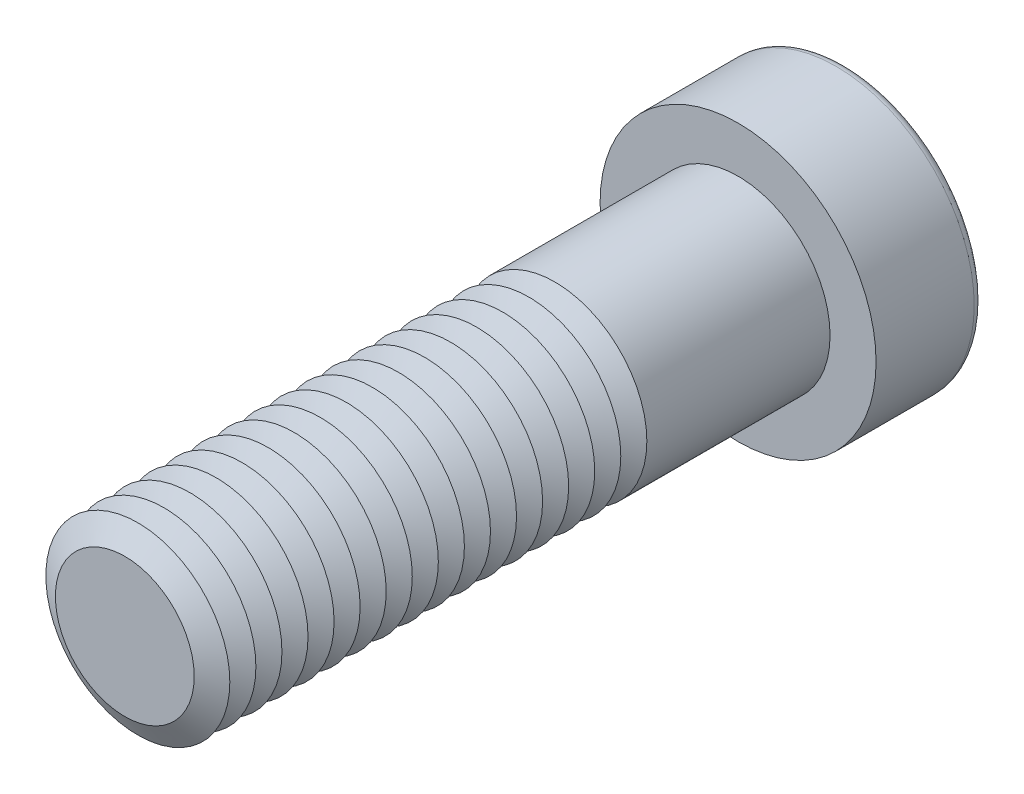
ISO-10303-21;
HEADER;
FILE_DESCRIPTION(('STEP AP214'),'2;1');
FILE_NAME('part.step','',(''),(''),'','','');
FILE_SCHEMA(('AUTOMOTIVE_DESIGN { 1 0 10303 214 1 1 1 1 }'));
ENDSEC;
DATA;
#1=APPLICATION_CONTEXT('core data for automotive mechanical design processes');
#2=APPLICATION_PROTOCOL_DEFINITION('international standard','automotive_design',2000,#1);
#3=PRODUCT_CONTEXT('',#1,'mechanical');
#4=PRODUCT('Part','Part','',(#3));
#5=PRODUCT_RELATED_PRODUCT_CATEGORY('part','',(#4));
#6=PRODUCT_DEFINITION_FORMATION('','',#4);
#7=PRODUCT_DEFINITION_CONTEXT('part definition',#1,'design');
#8=PRODUCT_DEFINITION('design','',#6,#7);
#9=PRODUCT_DEFINITION_SHAPE('','',#8);
#10=(LENGTH_UNIT() NAMED_UNIT(*) SI_UNIT(.MILLI.,.METRE.));
#11=(NAMED_UNIT(*) PLANE_ANGLE_UNIT() SI_UNIT($,.RADIAN.));
#12=(NAMED_UNIT(*) SI_UNIT($,.STERADIAN.) SOLID_ANGLE_UNIT());
#13=UNCERTAINTY_MEASURE_WITH_UNIT(LENGTH_MEASURE(1.E-05),#10,'distance_accuracy_value','');
#14=(GEOMETRIC_REPRESENTATION_CONTEXT(3) GLOBAL_UNCERTAINTY_ASSIGNED_CONTEXT((#13)) GLOBAL_UNIT_ASSIGNED_CONTEXT((#10,
#11,#12)) REPRESENTATION_CONTEXT('',''));
#15=CARTESIAN_POINT('',(0.,0.,0.));
#16=DIRECTION('',(0.,0.,1.));
#17=DIRECTION('',(1.,0.,0.));
#18=AXIS2_PLACEMENT_3D('',#15,#16,#17);
#19=CARTESIAN_POINT('',(0.,0.,34.05));
#20=DIRECTION('',(0.,0.,1.));
#21=DIRECTION('',(1.,0.,0.));
#22=AXIS2_PLACEMENT_3D('',#19,#20,#21);
#23=CONICAL_SURFACE('',#22,6.,1.0471975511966);
#24=CARTESIAN_POINT('',(0.,0.,33.2));
#25=DIRECTION('',(0.,0.,1.));
#26=DIRECTION('',(1.,0.,0.));
#27=AXIS2_PLACEMENT_3D('',#24,#25,#26);
#28=CIRCLE('',#27,4.52775681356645);
#29=CARTESIAN_POINT('',(4.52775681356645,0.,33.2));
#30=VERTEX_POINT('',#29);
#31=EDGE_CURVE('E314',#30,#30,#28,.T.);
#32=ORIENTED_EDGE('',*,*,#31,.T.);
#33=EDGE_LOOP('',(#32));
#34=FACE_BOUND('',#33,.T.);
#35=CARTESIAN_POINT('',(0.,0.,34.05));
#36=DIRECTION('',(0.,0.,1.));
#37=DIRECTION('',(1.,0.,0.));
#38=AXIS2_PLACEMENT_3D('',#35,#36,#37);
#39=CIRCLE('',#38,6.);
#40=CARTESIAN_POINT('',(6.,0.,34.05));
#41=VERTEX_POINT('',#40);
#42=EDGE_CURVE('E317',#41,#41,#39,.T.);
#43=ORIENTED_EDGE('',*,*,#42,.F.);
#44=EDGE_LOOP('',(#43));
#45=FACE_BOUND('',#44,.T.);
#46=ADVANCED_FACE('F39',(#34,#45),#23,.T.);
#47=CARTESIAN_POINT('',(0.,0.,33.2));
#48=DIRECTION('',(0.,0.,-1.));
#49=DIRECTION('',(-1.,0.,0.));
#50=AXIS2_PLACEMENT_3D('',#47,#48,#49);
#51=CONICAL_SURFACE('',#50,4.52775681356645,1.0471975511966);
#52=CARTESIAN_POINT('',(0.,0.,32.35));
#53=DIRECTION('',(0.,0.,1.));
#54=DIRECTION('',(1.,0.,0.));
#55=AXIS2_PLACEMENT_3D('',#52,#53,#54);
#56=CIRCLE('',#55,6.);
#57=CARTESIAN_POINT('',(6.,0.,32.35));
#58=VERTEX_POINT('',#57);
#59=EDGE_CURVE('E325',#58,#58,#56,.T.);
#60=ORIENTED_EDGE('',*,*,#59,.T.);
#61=EDGE_LOOP('',(#60));
#62=FACE_BOUND('',#61,.T.);
#63=ORIENTED_EDGE('',*,*,#31,.F.);
#64=EDGE_LOOP('',(#63));
#65=FACE_BOUND('',#64,.T.);
#66=ADVANCED_FACE('F245',(#62,#65),#51,.T.);
#67=CARTESIAN_POINT('',(0.,0.,40.));
#68=DIRECTION('',(0.,0.,1.));
#69=DIRECTION('',(1.,0.,0.));
#70=AXIS2_PLACEMENT_3D('',#67,#68,#69);
#71=PLANE('',#70);
#72=CARTESIAN_POINT('',(0.,0.,40.));
#73=DIRECTION('',(0.,0.,1.));
#74=DIRECTION('',(1.,0.,0.));
#75=AXIS2_PLACEMENT_3D('',#72,#73,#74);
#76=CIRCLE('',#75,4.52775681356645);
#77=CARTESIAN_POINT('',(4.52775681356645,0.,40.));
#78=VERTEX_POINT('',#77);
#79=EDGE_CURVE('E174',#78,#78,#76,.T.);
#80=ORIENTED_EDGE('',*,*,#79,.T.);
#81=EDGE_LOOP('',(#80));
#82=FACE_BOUND('',#81,.T.);
#83=ADVANCED_FACE('F251',(#82),#71,.T.);
#84=CARTESIAN_POINT('',(0.,0.,40.));
#85=DIRECTION('',(0.,0.,-1.));
#86=DIRECTION('',(-1.,0.,0.));
#87=AXIS2_PLACEMENT_3D('',#84,#85,#86);
#88=CONICAL_SURFACE('',#87,4.52775681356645,1.0471975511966);
#89=CARTESIAN_POINT('',(0.,0.,39.15));
#90=DIRECTION('',(0.,0.,1.));
#91=DIRECTION('',(1.,0.,0.));
#92=AXIS2_PLACEMENT_3D('',#89,#90,#91);
#93=CIRCLE('',#92,6.);
#94=CARTESIAN_POINT('',(6.,0.,39.15));
#95=VERTEX_POINT('',#94);
#96=EDGE_CURVE('E291',#95,#95,#93,.T.);
#97=ORIENTED_EDGE('',*,*,#96,.T.);
#98=EDGE_LOOP('',(#97));
#99=FACE_BOUND('',#98,.T.);
#100=ORIENTED_EDGE('',*,*,#79,.F.);
#101=EDGE_LOOP('',(#100));
#102=FACE_BOUND('',#101,.T.);
#103=ADVANCED_FACE('F199',(#99,#102),#88,.T.);
#104=CARTESIAN_POINT('',(0.,0.,39.15));
#105=DIRECTION('',(0.,0.,1.));
#106=DIRECTION('',(1.,0.,0.));
#107=AXIS2_PLACEMENT_3D('',#104,#105,#106);
#108=CONICAL_SURFACE('',#107,6.,1.0471975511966);
#109=CARTESIAN_POINT('',(0.,0.,38.3));
#110=DIRECTION('',(0.,0.,1.));
#111=DIRECTION('',(1.,0.,0.));
#112=AXIS2_PLACEMENT_3D('',#109,#110,#111);
#113=CIRCLE('',#112,4.52775681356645);
#114=CARTESIAN_POINT('',(4.52775681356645,0.,38.3));
#115=VERTEX_POINT('',#114);
#116=EDGE_CURVE('E288',#115,#115,#113,.T.);
#117=ORIENTED_EDGE('',*,*,#116,.T.);
#118=EDGE_LOOP('',(#117));
#119=FACE_BOUND('',#118,.T.);
#120=ORIENTED_EDGE('',*,*,#96,.F.);
#121=EDGE_LOOP('',(#120));
#122=FACE_BOUND('',#121,.T.);
#123=ADVANCED_FACE('F277',(#119,#122),#108,.T.);
#124=CARTESIAN_POINT('',(0.,0.,38.3));
#125=DIRECTION('',(0.,0.,-1.));
#126=DIRECTION('',(-1.,0.,0.));
#127=AXIS2_PLACEMENT_3D('',#124,#125,#126);
#128=CONICAL_SURFACE('',#127,4.52775681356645,1.0471975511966);
#129=CARTESIAN_POINT('',(0.,0.,37.45));
#130=DIRECTION('',(0.,0.,1.));
#131=DIRECTION('',(1.,0.,0.));
#132=AXIS2_PLACEMENT_3D('',#129,#130,#131);
#133=CIRCLE('',#132,6.);
#134=CARTESIAN_POINT('',(6.,0.,37.45));
#135=VERTEX_POINT('',#134);
#136=EDGE_CURVE('E300',#135,#135,#133,.T.);
#137=ORIENTED_EDGE('',*,*,#136,.T.);
#138=EDGE_LOOP('',(#137));
#139=FACE_BOUND('',#138,.T.);
#140=ORIENTED_EDGE('',*,*,#116,.F.);
#141=EDGE_LOOP('',(#140));
#142=FACE_BOUND('',#141,.T.);
#143=ADVANCED_FACE('F274',(#139,#142),#128,.T.);
#144=CARTESIAN_POINT('',(0.,0.,37.45));
#145=DIRECTION('',(0.,0.,1.));
#146=DIRECTION('',(1.,0.,0.));
#147=AXIS2_PLACEMENT_3D('',#144,#145,#146);
#148=CONICAL_SURFACE('',#147,6.,1.0471975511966);
#149=CARTESIAN_POINT('',(0.,0.,36.6));
#150=DIRECTION('',(0.,0.,1.));
#151=DIRECTION('',(1.,0.,0.));
#152=AXIS2_PLACEMENT_3D('',#149,#150,#151);
#153=CIRCLE('',#152,4.52775681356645);
#154=CARTESIAN_POINT('',(4.52775681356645,0.,36.6));
#155=VERTEX_POINT('',#154);
#156=EDGE_CURVE('E293',#155,#155,#153,.T.);
#157=ORIENTED_EDGE('',*,*,#156,.T.);
#158=EDGE_LOOP('',(#157));
#159=FACE_BOUND('',#158,.T.);
#160=ORIENTED_EDGE('',*,*,#136,.F.);
#161=EDGE_LOOP('',(#160));
#162=FACE_BOUND('',#161,.T.);
#163=ADVANCED_FACE('F270',(#159,#162),#148,.T.);
#164=CARTESIAN_POINT('',(0.,0.,36.6));
#165=DIRECTION('',(0.,0.,-1.));
#166=DIRECTION('',(-1.,0.,0.));
#167=AXIS2_PLACEMENT_3D('',#164,#165,#166);
#168=CONICAL_SURFACE('',#167,4.52775681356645,1.0471975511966);
#169=CARTESIAN_POINT('',(0.,0.,35.75));
#170=DIRECTION('',(0.,0.,1.));
#171=DIRECTION('',(1.,0.,0.));
#172=AXIS2_PLACEMENT_3D('',#169,#170,#171);
#173=CIRCLE('',#172,6.);
#174=CARTESIAN_POINT('',(6.,0.,35.75));
#175=VERTEX_POINT('',#174);
#176=EDGE_CURVE('E310',#175,#175,#173,.T.);
#177=ORIENTED_EDGE('',*,*,#176,.T.);
#178=EDGE_LOOP('',(#177));
#179=FACE_BOUND('',#178,.T.);
#180=ORIENTED_EDGE('',*,*,#156,.F.);
#181=EDGE_LOOP('',(#180));
#182=FACE_BOUND('',#181,.T.);
#183=ADVANCED_FACE('F266',(#179,#182),#168,.T.);
#184=CARTESIAN_POINT('',(0.,0.,35.75));
#185=DIRECTION('',(0.,0.,1.));
#186=DIRECTION('',(1.,0.,0.));
#187=AXIS2_PLACEMENT_3D('',#184,#185,#186);
#188=CONICAL_SURFACE('',#187,6.,1.0471975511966);
#189=CARTESIAN_POINT('',(0.,0.,34.9));
#190=DIRECTION('',(0.,0.,1.));
#191=DIRECTION('',(1.,0.,0.));
#192=AXIS2_PLACEMENT_3D('',#189,#190,#191);
#193=CIRCLE('',#192,4.52775681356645);
#194=CARTESIAN_POINT('',(4.52775681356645,0.,34.9));
#195=VERTEX_POINT('',#194);
#196=EDGE_CURVE('E306',#195,#195,#193,.T.);
#197=ORIENTED_EDGE('',*,*,#196,.T.);
#198=EDGE_LOOP('',(#197));
#199=FACE_BOUND('',#198,.T.);
#200=ORIENTED_EDGE('',*,*,#176,.F.);
#201=EDGE_LOOP('',(#200));
#202=FACE_BOUND('',#201,.T.);
#203=ADVANCED_FACE('F262',(#199,#202),#188,.T.);
#204=CARTESIAN_POINT('',(0.,0.,34.9));
#205=DIRECTION('',(0.,0.,-1.));
#206=DIRECTION('',(-1.,0.,0.));
#207=AXIS2_PLACEMENT_3D('',#204,#205,#206);
#208=CONICAL_SURFACE('',#207,4.52775681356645,1.0471975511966);
#209=ORIENTED_EDGE('',*,*,#42,.T.);
#210=EDGE_LOOP('',(#209));
#211=FACE_BOUND('',#210,.T.);
#212=ORIENTED_EDGE('',*,*,#196,.F.);
#213=EDGE_LOOP('',(#212));
#214=FACE_BOUND('',#213,.T.);
#215=ADVANCED_FACE('F258',(#211,#214),#208,.T.);
#216=CARTESIAN_POINT('',(0.,0.,32.35));
#217=DIRECTION('',(0.,0.,1.));
#218=DIRECTION('',(1.,0.,0.));
#219=AXIS2_PLACEMENT_3D('',#216,#217,#218);
#220=CONICAL_SURFACE('',#219,6.,1.0471975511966);
#221=CARTESIAN_POINT('',(0.,0.,31.5));
#222=DIRECTION('',(0.,0.,1.));
#223=DIRECTION('',(1.,0.,0.));
#224=AXIS2_PLACEMENT_3D('',#221,#222,#223);
#225=CIRCLE('',#224,4.52775681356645);
#226=CARTESIAN_POINT('',(4.52775681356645,0.,31.5));
#227=VERTEX_POINT('',#226);
#228=EDGE_CURVE('E321',#227,#227,#225,.T.);
#229=ORIENTED_EDGE('',*,*,#228,.T.);
#230=EDGE_LOOP('',(#229));
#231=FACE_BOUND('',#230,.T.);
#232=ORIENTED_EDGE('',*,*,#59,.F.);
#233=EDGE_LOOP('',(#232));
#234=FACE_BOUND('',#233,.T.);
#235=ADVANCED_FACE('F261',(#231,#234),#220,.T.);
#236=CARTESIAN_POINT('',(0.,0.,31.5));
#237=DIRECTION('',(0.,0.,-1.));
#238=DIRECTION('',(-1.,0.,0.));
#239=AXIS2_PLACEMENT_3D('',#236,#237,#238);
#240=CONICAL_SURFACE('',#239,4.52775681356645,1.0471975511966);
#241=CARTESIAN_POINT('',(0.,0.,30.65));
#242=DIRECTION('',(0.,0.,1.));
#243=DIRECTION('',(1.,0.,0.));
#244=AXIS2_PLACEMENT_3D('',#241,#242,#243);
#245=CIRCLE('',#244,6.);
#246=CARTESIAN_POINT('',(6.,0.,30.65));
#247=VERTEX_POINT('',#246);
#248=EDGE_CURVE('E333',#247,#247,#245,.T.);
#249=ORIENTED_EDGE('',*,*,#248,.T.);
#250=EDGE_LOOP('',(#249));
#251=FACE_BOUND('',#250,.T.);
#252=ORIENTED_EDGE('',*,*,#228,.F.);
#253=EDGE_LOOP('',(#252));
#254=FACE_BOUND('',#253,.T.);
#255=ADVANCED_FACE('F513',(#251,#254),#240,.T.);
#256=CARTESIAN_POINT('',(0.,0.,30.65));
#257=DIRECTION('',(0.,0.,1.));
#258=DIRECTION('',(1.,0.,0.));
#259=AXIS2_PLACEMENT_3D('',#256,#257,#258);
#260=CONICAL_SURFACE('',#259,6.,1.0471975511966);
#261=CARTESIAN_POINT('',(0.,0.,29.8));
#262=DIRECTION('',(0.,0.,1.));
#263=DIRECTION('',(1.,0.,0.));
#264=AXIS2_PLACEMENT_3D('',#261,#262,#263);
#265=CIRCLE('',#264,4.52775681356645);
#266=CARTESIAN_POINT('',(4.52775681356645,0.,29.8));
#267=VERTEX_POINT('',#266);
#268=EDGE_CURVE('E329',#267,#267,#265,.T.);
#269=ORIENTED_EDGE('',*,*,#268,.T.);
#270=EDGE_LOOP('',(#269));
#271=FACE_BOUND('',#270,.T.);
#272=ORIENTED_EDGE('',*,*,#248,.F.);
#273=EDGE_LOOP('',(#272));
#274=FACE_BOUND('',#273,.T.);
#275=ADVANCED_FACE('F509',(#271,#274),#260,.T.);
#276=CARTESIAN_POINT('',(0.,0.,29.8));
#277=DIRECTION('',(0.,0.,-1.));
#278=DIRECTION('',(-1.,0.,0.));
#279=AXIS2_PLACEMENT_3D('',#276,#277,#278);
#280=CONICAL_SURFACE('',#279,4.52775681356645,1.0471975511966);
#281=CARTESIAN_POINT('',(0.,0.,28.95));
#282=DIRECTION('',(0.,0.,1.));
#283=DIRECTION('',(1.,0.,0.));
#284=AXIS2_PLACEMENT_3D('',#281,#282,#283);
#285=CIRCLE('',#284,6.);
#286=CARTESIAN_POINT('',(6.,0.,28.95));
#287=VERTEX_POINT('',#286);
#288=EDGE_CURVE('E341',#287,#287,#285,.T.);
#289=ORIENTED_EDGE('',*,*,#288,.T.);
#290=EDGE_LOOP('',(#289));
#291=FACE_BOUND('',#290,.T.);
#292=ORIENTED_EDGE('',*,*,#268,.F.);
#293=EDGE_LOOP('',(#292));
#294=FACE_BOUND('',#293,.T.);
#295=ADVANCED_FACE('F505',(#291,#294),#280,.T.);
#296=CARTESIAN_POINT('',(0.,0.,28.95));
#297=DIRECTION('',(0.,0.,1.));
#298=DIRECTION('',(1.,0.,0.));
#299=AXIS2_PLACEMENT_3D('',#296,#297,#298);
#300=CONICAL_SURFACE('',#299,6.,1.0471975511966);
#301=CARTESIAN_POINT('',(0.,0.,28.1));
#302=DIRECTION('',(0.,0.,1.));
#303=DIRECTION('',(1.,0.,0.));
#304=AXIS2_PLACEMENT_3D('',#301,#302,#303);
#305=CIRCLE('',#304,4.52775681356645);
#306=CARTESIAN_POINT('',(4.52775681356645,0.,28.1));
#307=VERTEX_POINT('',#306);
#308=EDGE_CURVE('E337',#307,#307,#305,.T.);
#309=ORIENTED_EDGE('',*,*,#308,.T.);
#310=EDGE_LOOP('',(#309));
#311=FACE_BOUND('',#310,.T.);
#312=ORIENTED_EDGE('',*,*,#288,.F.);
#313=EDGE_LOOP('',(#312));
#314=FACE_BOUND('',#313,.T.);
#315=ADVANCED_FACE('F501',(#311,#314),#300,.T.);
#316=CARTESIAN_POINT('',(0.,0.,28.1));
#317=DIRECTION('',(0.,0.,-1.));
#318=DIRECTION('',(-1.,0.,0.));
#319=AXIS2_PLACEMENT_3D('',#316,#317,#318);
#320=CONICAL_SURFACE('',#319,4.52775681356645,1.0471975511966);
#321=CARTESIAN_POINT('',(0.,0.,27.25));
#322=DIRECTION('',(0.,0.,1.));
#323=DIRECTION('',(1.,0.,0.));
#324=AXIS2_PLACEMENT_3D('',#321,#322,#323);
#325=CIRCLE('',#324,6.);
#326=CARTESIAN_POINT('',(6.,0.,27.25));
#327=VERTEX_POINT('',#326);
#328=EDGE_CURVE('E349',#327,#327,#325,.T.);
#329=ORIENTED_EDGE('',*,*,#328,.T.);
#330=EDGE_LOOP('',(#329));
#331=FACE_BOUND('',#330,.T.);
#332=ORIENTED_EDGE('',*,*,#308,.F.);
#333=EDGE_LOOP('',(#332));
#334=FACE_BOUND('',#333,.T.);
#335=ADVANCED_FACE('F497',(#331,#334),#320,.T.);
#336=CARTESIAN_POINT('',(0.,0.,27.25));
#337=DIRECTION('',(0.,0.,1.));
#338=DIRECTION('',(1.,0.,0.));
#339=AXIS2_PLACEMENT_3D('',#336,#337,#338);
#340=CONICAL_SURFACE('',#339,6.,1.0471975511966);
#341=CARTESIAN_POINT('',(0.,0.,26.4));
#342=DIRECTION('',(0.,0.,1.));
#343=DIRECTION('',(1.,0.,0.));
#344=AXIS2_PLACEMENT_3D('',#341,#342,#343);
#345=CIRCLE('',#344,4.52775681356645);
#346=CARTESIAN_POINT('',(4.52775681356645,0.,26.4));
#347=VERTEX_POINT('',#346);
#348=EDGE_CURVE('E345',#347,#347,#345,.T.);
#349=ORIENTED_EDGE('',*,*,#348,.T.);
#350=EDGE_LOOP('',(#349));
#351=FACE_BOUND('',#350,.T.);
#352=ORIENTED_EDGE('',*,*,#328,.F.);
#353=EDGE_LOOP('',(#352));
#354=FACE_BOUND('',#353,.T.);
#355=ADVANCED_FACE('F493',(#351,#354),#340,.T.);
#356=CARTESIAN_POINT('',(0.,0.,26.4));
#357=DIRECTION('',(0.,0.,-1.));
#358=DIRECTION('',(-1.,0.,0.));
#359=AXIS2_PLACEMENT_3D('',#356,#357,#358);
#360=CONICAL_SURFACE('',#359,4.52775681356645,1.0471975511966);
#361=CARTESIAN_POINT('',(0.,0.,25.55));
#362=DIRECTION('',(0.,0.,1.));
#363=DIRECTION('',(1.,0.,0.));
#364=AXIS2_PLACEMENT_3D('',#361,#362,#363);
#365=CIRCLE('',#364,6.);
#366=CARTESIAN_POINT('',(6.,0.,25.55));
#367=VERTEX_POINT('',#366);
#368=EDGE_CURVE('E357',#367,#367,#365,.T.);
#369=ORIENTED_EDGE('',*,*,#368,.T.);
#370=EDGE_LOOP('',(#369));
#371=FACE_BOUND('',#370,.T.);
#372=ORIENTED_EDGE('',*,*,#348,.F.);
#373=EDGE_LOOP('',(#372));
#374=FACE_BOUND('',#373,.T.);
#375=ADVANCED_FACE('F489',(#371,#374),#360,.T.);
#376=CARTESIAN_POINT('',(0.,0.,25.55));
#377=DIRECTION('',(0.,0.,1.));
#378=DIRECTION('',(1.,0.,0.));
#379=AXIS2_PLACEMENT_3D('',#376,#377,#378);
#380=CONICAL_SURFACE('',#379,6.,1.0471975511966);
#381=CARTESIAN_POINT('',(0.,0.,24.7));
#382=DIRECTION('',(0.,0.,1.));
#383=DIRECTION('',(1.,0.,0.));
#384=AXIS2_PLACEMENT_3D('',#381,#382,#383);
#385=CIRCLE('',#384,4.52775681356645);
#386=CARTESIAN_POINT('',(4.52775681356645,0.,24.7));
#387=VERTEX_POINT('',#386);
#388=EDGE_CURVE('E353',#387,#387,#385,.T.);
#389=ORIENTED_EDGE('',*,*,#388,.T.);
#390=EDGE_LOOP('',(#389));
#391=FACE_BOUND('',#390,.T.);
#392=ORIENTED_EDGE('',*,*,#368,.F.);
#393=EDGE_LOOP('',(#392));
#394=FACE_BOUND('',#393,.T.);
#395=ADVANCED_FACE('F485',(#391,#394),#380,.T.);
#396=CARTESIAN_POINT('',(0.,0.,24.7));
#397=DIRECTION('',(0.,0.,-1.));
#398=DIRECTION('',(-1.,0.,0.));
#399=AXIS2_PLACEMENT_3D('',#396,#397,#398);
#400=CONICAL_SURFACE('',#399,4.52775681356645,1.0471975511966);
#401=CARTESIAN_POINT('',(0.,0.,23.85));
#402=DIRECTION('',(0.,0.,1.));
#403=DIRECTION('',(1.,0.,0.));
#404=AXIS2_PLACEMENT_3D('',#401,#402,#403);
#405=CIRCLE('',#404,6.);
#406=CARTESIAN_POINT('',(6.,0.,23.85));
#407=VERTEX_POINT('',#406);
#408=EDGE_CURVE('E365',#407,#407,#405,.T.);
#409=ORIENTED_EDGE('',*,*,#408,.T.);
#410=EDGE_LOOP('',(#409));
#411=FACE_BOUND('',#410,.T.);
#412=ORIENTED_EDGE('',*,*,#388,.F.);
#413=EDGE_LOOP('',(#412));
#414=FACE_BOUND('',#413,.T.);
#415=ADVANCED_FACE('F481',(#411,#414),#400,.T.);
#416=CARTESIAN_POINT('',(0.,0.,23.85));
#417=DIRECTION('',(0.,0.,1.));
#418=DIRECTION('',(1.,0.,0.));
#419=AXIS2_PLACEMENT_3D('',#416,#417,#418);
#420=CONICAL_SURFACE('',#419,6.,1.0471975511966);
#421=CARTESIAN_POINT('',(0.,0.,23.));
#422=DIRECTION('',(0.,0.,1.));
#423=DIRECTION('',(1.,0.,0.));
#424=AXIS2_PLACEMENT_3D('',#421,#422,#423);
#425=CIRCLE('',#424,4.52775681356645);
#426=CARTESIAN_POINT('',(4.52775681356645,0.,23.));
#427=VERTEX_POINT('',#426);
#428=EDGE_CURVE('E361',#427,#427,#425,.T.);
#429=ORIENTED_EDGE('',*,*,#428,.T.);
#430=EDGE_LOOP('',(#429));
#431=FACE_BOUND('',#430,.T.);
#432=ORIENTED_EDGE('',*,*,#408,.F.);
#433=EDGE_LOOP('',(#432));
#434=FACE_BOUND('',#433,.T.);
#435=ADVANCED_FACE('F477',(#431,#434),#420,.T.);
#436=CARTESIAN_POINT('',(0.,0.,23.));
#437=DIRECTION('',(0.,0.,-1.));
#438=DIRECTION('',(-1.,0.,0.));
#439=AXIS2_PLACEMENT_3D('',#436,#437,#438);
#440=CONICAL_SURFACE('',#439,4.52775681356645,1.0471975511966);
#441=CARTESIAN_POINT('',(0.,0.,22.15));
#442=DIRECTION('',(0.,0.,1.));
#443=DIRECTION('',(1.,0.,0.));
#444=AXIS2_PLACEMENT_3D('',#441,#442,#443);
#445=CIRCLE('',#444,6.);
#446=CARTESIAN_POINT('',(6.,0.,22.15));
#447=VERTEX_POINT('',#446);
#448=EDGE_CURVE('E372',#447,#447,#445,.T.);
#449=ORIENTED_EDGE('',*,*,#448,.T.);
#450=EDGE_LOOP('',(#449));
#451=FACE_BOUND('',#450,.T.);
#452=ORIENTED_EDGE('',*,*,#428,.F.);
#453=EDGE_LOOP('',(#452));
#454=FACE_BOUND('',#453,.T.);
#455=ADVANCED_FACE('F473',(#451,#454),#440,.T.);
#456=CARTESIAN_POINT('',(0.,0.,22.15));
#457=DIRECTION('',(0.,0.,1.));
#458=DIRECTION('',(1.,0.,0.));
#459=AXIS2_PLACEMENT_3D('',#456,#457,#458);
#460=CONICAL_SURFACE('',#459,6.,1.0471975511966);
#461=CARTESIAN_POINT('',(0.,0.,21.3));
#462=DIRECTION('',(0.,0.,1.));
#463=DIRECTION('',(1.,0.,0.));
#464=AXIS2_PLACEMENT_3D('',#461,#462,#463);
#465=CIRCLE('',#464,4.52775681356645);
#466=CARTESIAN_POINT('',(4.52775681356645,0.,21.3));
#467=VERTEX_POINT('',#466);
#468=EDGE_CURVE('E369',#467,#467,#465,.T.);
#469=ORIENTED_EDGE('',*,*,#468,.T.);
#470=EDGE_LOOP('',(#469));
#471=FACE_BOUND('',#470,.T.);
#472=ORIENTED_EDGE('',*,*,#448,.F.);
#473=EDGE_LOOP('',(#472));
#474=FACE_BOUND('',#473,.T.);
#475=ADVANCED_FACE('F469',(#471,#474),#460,.T.);
#476=CARTESIAN_POINT('',(0.,0.,21.3));
#477=DIRECTION('',(0.,0.,-1.));
#478=DIRECTION('',(-1.,0.,0.));
#479=AXIS2_PLACEMENT_3D('',#476,#477,#478);
#480=CONICAL_SURFACE('',#479,4.52775681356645,1.0471975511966);
#481=CARTESIAN_POINT('',(0.,0.,20.45));
#482=DIRECTION('',(0.,0.,1.));
#483=DIRECTION('',(1.,0.,0.));
#484=AXIS2_PLACEMENT_3D('',#481,#482,#483);
#485=CIRCLE('',#484,6.);
#486=CARTESIAN_POINT('',(6.,0.,20.45));
#487=VERTEX_POINT('',#486);
#488=EDGE_CURVE('E380',#487,#487,#485,.T.);
#489=ORIENTED_EDGE('',*,*,#488,.T.);
#490=EDGE_LOOP('',(#489));
#491=FACE_BOUND('',#490,.T.);
#492=ORIENTED_EDGE('',*,*,#468,.F.);
#493=EDGE_LOOP('',(#492));
#494=FACE_BOUND('',#493,.T.);
#495=ADVANCED_FACE('F465',(#491,#494),#480,.T.);
#496=CARTESIAN_POINT('',(0.,0.,20.45));
#497=DIRECTION('',(0.,0.,1.));
#498=DIRECTION('',(1.,0.,0.));
#499=AXIS2_PLACEMENT_3D('',#496,#497,#498);
#500=CONICAL_SURFACE('',#499,6.,1.0471975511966);
#501=CARTESIAN_POINT('',(0.,0.,19.6));
#502=DIRECTION('',(0.,0.,1.));
#503=DIRECTION('',(1.,0.,0.));
#504=AXIS2_PLACEMENT_3D('',#501,#502,#503);
#505=CIRCLE('',#504,4.52775681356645);
#506=CARTESIAN_POINT('',(4.52775681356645,0.,19.6));
#507=VERTEX_POINT('',#506);
#508=EDGE_CURVE('E376',#507,#507,#505,.T.);
#509=ORIENTED_EDGE('',*,*,#508,.T.);
#510=EDGE_LOOP('',(#509));
#511=FACE_BOUND('',#510,.T.);
#512=ORIENTED_EDGE('',*,*,#488,.F.);
#513=EDGE_LOOP('',(#512));
#514=FACE_BOUND('',#513,.T.);
#515=ADVANCED_FACE('F461',(#511,#514),#500,.T.);
#516=CARTESIAN_POINT('',(0.,0.,19.6));
#517=DIRECTION('',(0.,0.,-1.));
#518=DIRECTION('',(-1.,0.,0.));
#519=AXIS2_PLACEMENT_3D('',#516,#517,#518);
#520=CONICAL_SURFACE('',#519,4.52775681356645,1.0471975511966);
#521=CARTESIAN_POINT('',(0.,0.,18.75));
#522=DIRECTION('',(0.,0.,1.));
#523=DIRECTION('',(1.,0.,0.));
#524=AXIS2_PLACEMENT_3D('',#521,#522,#523);
#525=CIRCLE('',#524,6.);
#526=CARTESIAN_POINT('',(6.,0.,18.75));
#527=VERTEX_POINT('',#526);
#528=EDGE_CURVE('E388',#527,#527,#525,.T.);
#529=ORIENTED_EDGE('',*,*,#528,.T.);
#530=EDGE_LOOP('',(#529));
#531=FACE_BOUND('',#530,.T.);
#532=ORIENTED_EDGE('',*,*,#508,.F.);
#533=EDGE_LOOP('',(#532));
#534=FACE_BOUND('',#533,.T.);
#535=ADVANCED_FACE('F457',(#531,#534),#520,.T.);
#536=CARTESIAN_POINT('',(0.,0.,18.75));
#537=DIRECTION('',(0.,0.,1.));
#538=DIRECTION('',(1.,0.,0.));
#539=AXIS2_PLACEMENT_3D('',#536,#537,#538);
#540=CONICAL_SURFACE('',#539,6.,1.0471975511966);
#541=CARTESIAN_POINT('',(0.,0.,17.9));
#542=DIRECTION('',(0.,0.,1.));
#543=DIRECTION('',(1.,0.,0.));
#544=AXIS2_PLACEMENT_3D('',#541,#542,#543);
#545=CIRCLE('',#544,4.52775681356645);
#546=CARTESIAN_POINT('',(4.52775681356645,0.,17.9));
#547=VERTEX_POINT('',#546);
#548=EDGE_CURVE('E384',#547,#547,#545,.T.);
#549=ORIENTED_EDGE('',*,*,#548,.T.);
#550=EDGE_LOOP('',(#549));
#551=FACE_BOUND('',#550,.T.);
#552=ORIENTED_EDGE('',*,*,#528,.F.);
#553=EDGE_LOOP('',(#552));
#554=FACE_BOUND('',#553,.T.);
#555=ADVANCED_FACE('F453',(#551,#554),#540,.T.);
#556=CARTESIAN_POINT('',(0.,0.,17.9));
#557=DIRECTION('',(0.,0.,-1.));
#558=DIRECTION('',(-1.,0.,0.));
#559=AXIS2_PLACEMENT_3D('',#556,#557,#558);
#560=CONICAL_SURFACE('',#559,4.52775681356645,1.0471975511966);
#561=CARTESIAN_POINT('',(0.,0.,17.05));
#562=DIRECTION('',(0.,0.,1.));
#563=DIRECTION('',(1.,0.,0.));
#564=AXIS2_PLACEMENT_3D('',#561,#562,#563);
#565=CIRCLE('',#564,6.);
#566=CARTESIAN_POINT('',(6.,0.,17.05));
#567=VERTEX_POINT('',#566);
#568=EDGE_CURVE('E396',#567,#567,#565,.T.);
#569=ORIENTED_EDGE('',*,*,#568,.T.);
#570=EDGE_LOOP('',(#569));
#571=FACE_BOUND('',#570,.T.);
#572=ORIENTED_EDGE('',*,*,#548,.F.);
#573=EDGE_LOOP('',(#572));
#574=FACE_BOUND('',#573,.T.);
#575=ADVANCED_FACE('F449',(#571,#574),#560,.T.);
#576=CARTESIAN_POINT('',(0.,0.,17.05));
#577=DIRECTION('',(0.,0.,1.));
#578=DIRECTION('',(1.,0.,0.));
#579=AXIS2_PLACEMENT_3D('',#576,#577,#578);
#580=CONICAL_SURFACE('',#579,6.,1.0471975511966);
#581=CARTESIAN_POINT('',(0.,0.,16.2));
#582=DIRECTION('',(0.,0.,1.));
#583=DIRECTION('',(1.,0.,0.));
#584=AXIS2_PLACEMENT_3D('',#581,#582,#583);
#585=CIRCLE('',#584,4.52775681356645);
#586=CARTESIAN_POINT('',(4.52775681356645,0.,16.2));
#587=VERTEX_POINT('',#586);
#588=EDGE_CURVE('E392',#587,#587,#585,.T.);
#589=ORIENTED_EDGE('',*,*,#588,.T.);
#590=EDGE_LOOP('',(#589));
#591=FACE_BOUND('',#590,.T.);
#592=ORIENTED_EDGE('',*,*,#568,.F.);
#593=EDGE_LOOP('',(#592));
#594=FACE_BOUND('',#593,.T.);
#595=ADVANCED_FACE('F445',(#591,#594),#580,.T.);
#596=CARTESIAN_POINT('',(0.,0.,16.2));
#597=DIRECTION('',(0.,0.,-1.));
#598=DIRECTION('',(-1.,0.,0.));
#599=AXIS2_PLACEMENT_3D('',#596,#597,#598);
#600=CONICAL_SURFACE('',#599,4.52775681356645,1.0471975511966);
#601=CARTESIAN_POINT('',(0.,0.,15.35));
#602=DIRECTION('',(0.,0.,1.));
#603=DIRECTION('',(1.,0.,0.));
#604=AXIS2_PLACEMENT_3D('',#601,#602,#603);
#605=CIRCLE('',#604,6.);
#606=CARTESIAN_POINT('',(6.,0.,15.35));
#607=VERTEX_POINT('',#606);
#608=EDGE_CURVE('E404',#607,#607,#605,.T.);
#609=ORIENTED_EDGE('',*,*,#608,.T.);
#610=EDGE_LOOP('',(#609));
#611=FACE_BOUND('',#610,.T.);
#612=ORIENTED_EDGE('',*,*,#588,.F.);
#613=EDGE_LOOP('',(#612));
#614=FACE_BOUND('',#613,.T.);
#615=ADVANCED_FACE('F441',(#611,#614),#600,.T.);
#616=CARTESIAN_POINT('',(0.,0.,15.35));
#617=DIRECTION('',(0.,0.,1.));
#618=DIRECTION('',(1.,0.,0.));
#619=AXIS2_PLACEMENT_3D('',#616,#617,#618);
#620=CONICAL_SURFACE('',#619,6.,1.0471975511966);
#621=CARTESIAN_POINT('',(0.,0.,14.5));
#622=DIRECTION('',(0.,0.,1.));
#623=DIRECTION('',(1.,0.,0.));
#624=AXIS2_PLACEMENT_3D('',#621,#622,#623);
#625=CIRCLE('',#624,4.52775681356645);
#626=CARTESIAN_POINT('',(4.52775681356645,0.,14.5));
#627=VERTEX_POINT('',#626);
#628=EDGE_CURVE('E400',#627,#627,#625,.T.);
#629=ORIENTED_EDGE('',*,*,#628,.T.);
#630=EDGE_LOOP('',(#629));
#631=FACE_BOUND('',#630,.T.);
#632=ORIENTED_EDGE('',*,*,#608,.F.);
#633=EDGE_LOOP('',(#632));
#634=FACE_BOUND('',#633,.T.);
#635=ADVANCED_FACE('F436',(#631,#634),#620,.T.);
#636=CARTESIAN_POINT('',(0.,0.,14.5));
#637=DIRECTION('',(0.,0.,-1.));
#638=DIRECTION('',(-1.,0.,0.));
#639=AXIS2_PLACEMENT_3D('',#636,#637,#638);
#640=CONICAL_SURFACE('',#639,4.52775681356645,1.0471975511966);
#641=CARTESIAN_POINT('',(0.,0.,13.65));
#642=DIRECTION('',(0.,0.,1.));
#643=DIRECTION('',(1.,0.,0.));
#644=AXIS2_PLACEMENT_3D('',#641,#642,#643);
#645=CIRCLE('',#644,6.);
#646=CARTESIAN_POINT('',(6.,0.,13.65));
#647=VERTEX_POINT('',#646);
#648=EDGE_CURVE('E416',#647,#647,#645,.T.);
#649=ORIENTED_EDGE('',*,*,#648,.T.);
#650=EDGE_LOOP('',(#649));
#651=FACE_BOUND('',#650,.T.);
#652=ORIENTED_EDGE('',*,*,#628,.F.);
#653=EDGE_LOOP('',(#652));
#654=FACE_BOUND('',#653,.T.);
#655=ADVANCED_FACE('F422',(#651,#654),#640,.T.);
#656=CARTESIAN_POINT('',(0.,0.,13.65));
#657=DIRECTION('',(0.,0.,1.));
#658=DIRECTION('',(1.,0.,0.));
#659=AXIS2_PLACEMENT_3D('',#656,#657,#658);
#660=CONICAL_SURFACE('',#659,6.,1.0471975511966);
#661=CARTESIAN_POINT('',(0.,0.,12.8));
#662=DIRECTION('',(0.,0.,1.));
#663=DIRECTION('',(1.,0.,0.));
#664=AXIS2_PLACEMENT_3D('',#661,#662,#663);
#665=CIRCLE('',#664,4.52775681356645);
#666=CARTESIAN_POINT('',(4.52775681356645,0.,12.8));
#667=VERTEX_POINT('',#666);
#668=EDGE_CURVE('E408',#667,#667,#665,.T.);
#669=ORIENTED_EDGE('',*,*,#668,.T.);
#670=EDGE_LOOP('',(#669));
#671=FACE_BOUND('',#670,.T.);
#672=ORIENTED_EDGE('',*,*,#648,.F.);
#673=EDGE_LOOP('',(#672));
#674=FACE_BOUND('',#673,.T.);
#675=ADVANCED_FACE('F425',(#671,#674),#660,.T.);
#676=CARTESIAN_POINT('',(0.,0.,12.8));
#677=DIRECTION('',(0.,0.,-1.));
#678=DIRECTION('',(-1.,0.,0.));
#679=AXIS2_PLACEMENT_3D('',#676,#677,#678);
#680=CONICAL_SURFACE('',#679,4.52775681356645,1.0471975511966);
#681=CARTESIAN_POINT('',(0.,0.,11.95));
#682=DIRECTION('',(0.,0.,1.));
#683=DIRECTION('',(1.,0.,0.));
#684=AXIS2_PLACEMENT_3D('',#681,#682,#683);
#685=CIRCLE('',#684,6.);
#686=CARTESIAN_POINT('',(6.,0.,11.95));
#687=VERTEX_POINT('',#686);
#688=EDGE_CURVE('E412',#687,#687,#685,.T.);
#689=ORIENTED_EDGE('',*,*,#688,.T.);
#690=EDGE_LOOP('',(#689));
#691=FACE_BOUND('',#690,.T.);
#692=ORIENTED_EDGE('',*,*,#668,.F.);
#693=EDGE_LOOP('',(#692));
#694=FACE_BOUND('',#693,.T.);
#695=ADVANCED_FACE('F427',(#691,#694),#680,.T.);
#696=CARTESIAN_POINT('',(0.,0.,-1.));
#697=DIRECTION('',(0.,0.,-1.));
#698=DIRECTION('',(-1.,0.,0.));
#699=AXIS2_PLACEMENT_3D('',#696,#697,#698);
#700=CONICAL_SURFACE('',#699,4.,1.0471975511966);
#701=CARTESIAN_POINT('',(0.,0.,1.30940107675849));
#702=VERTEX_POINT('',#701);
#703=VERTEX_LOOP('',#702);
#704=FACE_BOUND('',#703,.T.);
#705=CARTESIAN_POINT('',(0.,0.,-1.));
#706=DIRECTION('',(0.,0.,-1.));
#707=DIRECTION('',(-1.,0.,0.));
#708=AXIS2_PLACEMENT_3D('',#705,#706,#707);
#709=CIRCLE('',#708,4.);
#710=CARTESIAN_POINT('',(-3.46410161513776,2.,-1.));
#711=VERTEX_POINT('',#710);
#712=CARTESIAN_POINT('',(0.,4.,-1.));
#713=VERTEX_POINT('',#712);
#714=EDGE_CURVE('E149',#711,#713,#709,.T.);
#715=ORIENTED_EDGE('',*,*,#714,.T.);
#716=CARTESIAN_POINT('',(0.,0.,-1.));
#717=DIRECTION('',(0.,0.,-1.));
#718=DIRECTION('',(-1.,0.,0.));
#719=AXIS2_PLACEMENT_3D('',#716,#717,#718);
#720=CIRCLE('',#719,4.);
#721=CARTESIAN_POINT('',(3.46410161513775,2.,-1.));
#722=VERTEX_POINT('',#721);
#723=EDGE_CURVE('E54',#713,#722,#720,.T.);
#724=ORIENTED_EDGE('',*,*,#723,.T.);
#725=CARTESIAN_POINT('',(3.46410161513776,-2.,-1.));
#726=VERTEX_POINT('',#725);
#727=EDGE_CURVE('E1028',#722,#726,#720,.T.);
#728=ORIENTED_EDGE('',*,*,#727,.T.);
#729=CARTESIAN_POINT('',(0.,-4.,-1.));
#730=VERTEX_POINT('',#729);
#731=EDGE_CURVE('E1026',#726,#730,#720,.T.);
#732=ORIENTED_EDGE('',*,*,#731,.T.);
#733=CARTESIAN_POINT('',(-3.46410161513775,-2.,-1.));
#734=VERTEX_POINT('',#733);
#735=EDGE_CURVE('E1021',#730,#734,#720,.T.);
#736=ORIENTED_EDGE('',*,*,#735,.T.);
#737=EDGE_CURVE('E1019',#734,#711,#720,.T.);
#738=ORIENTED_EDGE('',*,*,#737,.T.);
#739=EDGE_LOOP('',(#715,#724,#728,#732,#736,#738));
#740=FACE_BOUND('',#739,.T.);
#741=ADVANCED_FACE('F201',(#704,#740),#700,.F.);
#742=CARTESIAN_POINT('',(0.,0.,-1.));
#743=DIRECTION('',(0.,0.,-1.));
#744=DIRECTION('',(-1.,0.,0.));
#745=AXIS2_PLACEMENT_3D('',#742,#743,#744);
#746=PLANE('',#745);
#747=ORIENTED_EDGE('',*,*,#723,.F.);
#748=DIRECTION('',(1.,0.,0.));
#749=VECTOR('',#748,1.);
#750=CARTESIAN_POINT('',(-2.3094010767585,4.,-1.));
#751=LINE('',#750,#749);
#752=CARTESIAN_POINT('',(2.3094010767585,4.,-1.));
#753=VERTEX_POINT('',#752);
#754=EDGE_CURVE('E1067',#713,#753,#751,.T.);
#755=ORIENTED_EDGE('',*,*,#754,.T.);
#756=DIRECTION('',(0.5,-0.866025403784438,0.));
#757=VECTOR('',#756,1.);
#758=CARTESIAN_POINT('',(2.3094010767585,4.,-1.));
#759=LINE('',#758,#757);
#760=EDGE_CURVE('E155',#753,#722,#759,.T.);
#761=ORIENTED_EDGE('',*,*,#760,.T.);
#762=EDGE_LOOP('',(#747,#755,#761));
#763=FACE_BOUND('',#762,.T.);
#764=ADVANCED_FACE('F608',(#763),#746,.T.);
#765=ORIENTED_EDGE('',*,*,#727,.F.);
#766=CARTESIAN_POINT('',(4.61880215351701,0.,-1.));
#767=VERTEX_POINT('',#766);
#768=EDGE_CURVE('E1070',#722,#767,#759,.T.);
#769=ORIENTED_EDGE('',*,*,#768,.T.);
#770=DIRECTION('',(-0.5,-0.866025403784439,0.));
#771=VECTOR('',#770,1.);
#772=CARTESIAN_POINT('',(4.61880215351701,0.,-1.));
#773=LINE('',#772,#771);
#774=EDGE_CURVE('E1042',#767,#726,#773,.T.);
#775=ORIENTED_EDGE('',*,*,#774,.T.);
#776=EDGE_LOOP('',(#765,#769,#775));
#777=FACE_BOUND('',#776,.T.);
#778=ADVANCED_FACE('F618',(#777),#746,.T.);
#779=ORIENTED_EDGE('',*,*,#731,.F.);
#780=CARTESIAN_POINT('',(2.3094010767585,-4.,-1.));
#781=VERTEX_POINT('',#780);
#782=EDGE_CURVE('E1044',#726,#781,#773,.T.);
#783=ORIENTED_EDGE('',*,*,#782,.T.);
#784=DIRECTION('',(-1.,0.,0.));
#785=VECTOR('',#784,1.);
#786=CARTESIAN_POINT('',(2.3094010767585,-4.,-1.));
#787=LINE('',#786,#785);
#788=EDGE_CURVE('E993',#781,#730,#787,.T.);
#789=ORIENTED_EDGE('',*,*,#788,.T.);
#790=EDGE_LOOP('',(#779,#783,#789));
#791=FACE_BOUND('',#790,.T.);
#792=ADVANCED_FACE('F628',(#791),#746,.T.);
#793=ORIENTED_EDGE('',*,*,#735,.F.);
#794=CARTESIAN_POINT('',(-2.3094010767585,-4.,-1.));
#795=VERTEX_POINT('',#794);
#796=EDGE_CURVE('E1038',#730,#795,#787,.T.);
#797=ORIENTED_EDGE('',*,*,#796,.T.);
#798=DIRECTION('',(-0.5,0.866025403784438,0.));
#799=VECTOR('',#798,1.);
#800=CARTESIAN_POINT('',(-2.3094010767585,-4.,-1.));
#801=LINE('',#800,#799);
#802=EDGE_CURVE('E1040',#795,#734,#801,.T.);
#803=ORIENTED_EDGE('',*,*,#802,.T.);
#804=EDGE_LOOP('',(#793,#797,#803));
#805=FACE_BOUND('',#804,.T.);
#806=ADVANCED_FACE('F636',(#805),#746,.T.);
#807=ORIENTED_EDGE('',*,*,#737,.F.);
#808=CARTESIAN_POINT('',(-4.61880215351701,0.,-1.));
#809=VERTEX_POINT('',#808);
#810=EDGE_CURVE('E1046',#734,#809,#801,.T.);
#811=ORIENTED_EDGE('',*,*,#810,.T.);
#812=DIRECTION('',(0.5,0.866025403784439,0.));
#813=VECTOR('',#812,1.);
#814=CARTESIAN_POINT('',(-4.61880215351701,0.,-1.));
#815=LINE('',#814,#813);
#816=EDGE_CURVE('E158',#809,#711,#815,.T.);
#817=ORIENTED_EDGE('',*,*,#816,.T.);
#818=EDGE_LOOP('',(#807,#811,#817));
#819=FACE_BOUND('',#818,.T.);
#820=ADVANCED_FACE('F231',(#819),#746,.T.);
#821=ORIENTED_EDGE('',*,*,#714,.F.);
#822=CARTESIAN_POINT('',(-2.3094010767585,4.,-1.));
#823=VERTEX_POINT('',#822);
#824=EDGE_CURVE('E1054',#711,#823,#815,.T.);
#825=ORIENTED_EDGE('',*,*,#824,.T.);
#826=EDGE_CURVE('E1065',#823,#713,#751,.T.);
#827=ORIENTED_EDGE('',*,*,#826,.T.);
#828=EDGE_LOOP('',(#821,#825,#827));
#829=FACE_BOUND('',#828,.T.);
#830=ADVANCED_FACE('F620',(#829),#746,.T.);
#831=CARTESIAN_POINT('',(-2.3094010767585,4.,-1.));
#832=DIRECTION('',(0.,1.,0.));
#833=DIRECTION('',(0.,0.,1.));
#834=AXIS2_PLACEMENT_3D('',#831,#832,#833);
#835=PLANE('',#834);
#836=DIRECTION('',(0.,0.,-1.));
#837=VECTOR('',#836,1.);
#838=CARTESIAN_POINT('',(-2.3094010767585,4.,-1.));
#839=LINE('',#838,#837);
#840=CARTESIAN_POINT('',(-2.3094010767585,4.,-7.));
#841=VERTEX_POINT('',#840);
#842=EDGE_CURVE('E147',#823,#841,#839,.T.);
#843=ORIENTED_EDGE('',*,*,#842,.T.);
#844=CARTESIAN_POINT('',(-6.02881516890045,4.,-7.70103379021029));
#845=CARTESIAN_POINT('',(-5.8481958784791,4.,-7.66071709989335));
#846=CARTESIAN_POINT('',(-5.66746141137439,4.,-7.62090727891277));
#847=CARTESIAN_POINT('',(-5.30570552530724,4.,-7.54257487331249));
#848=CARTESIAN_POINT('',(-5.12468409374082,4.,-7.50405234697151));
#849=CARTESIAN_POINT('',(-4.76212658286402,4.,-7.42853268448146));
#850=CARTESIAN_POINT('',(-4.58059016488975,4.,-7.39153716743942));
#851=CARTESIAN_POINT('',(-4.21713405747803,4.,-7.31948392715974));
#852=CARTESIAN_POINT('',(-4.03521437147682,4.,-7.28442618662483));
#853=CARTESIAN_POINT('',(-3.67250657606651,4.,-7.21700168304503));
#854=CARTESIAN_POINT('',(-3.4917223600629,4.,-7.18461419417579));
#855=CARTESIAN_POINT('',(-3.12965653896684,4.,-7.12275774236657));
#856=CARTESIAN_POINT('',(-2.94837492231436,4.,-7.09328884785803));
#857=CARTESIAN_POINT('',(-2.40374454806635,4.,-7.01026455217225));
#858=CARTESIAN_POINT('',(-2.03952090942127,4.,-6.96207428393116));
#859=CARTESIAN_POINT('',(-1.48950033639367,4.,-6.90518200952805));
#860=CARTESIAN_POINT('',(-1.30450135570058,4.,-6.88873552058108));
#861=CARTESIAN_POINT('',(-0.934053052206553,4.,-6.86198845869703));
#862=CARTESIAN_POINT('',(-0.748603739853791,4.,-6.85168774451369));
#863=CARTESIAN_POINT('',(-0.377528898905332,4.,-6.83783090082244));
#864=CARTESIAN_POINT('',(-0.191903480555,4.,-6.83427186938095));
#865=CARTESIAN_POINT('',(0.179350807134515,4.,-6.83411569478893));
#866=CARTESIAN_POINT('',(0.364979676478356,4.,-6.83751856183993));
#867=CARTESIAN_POINT('',(0.736742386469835,4.,-6.85109802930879));
#868=CARTESIAN_POINT('',(0.922875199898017,4.,-6.86130219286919));
#869=CARTESIAN_POINT('',(1.29469888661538,4.,-6.8879135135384));
#870=CARTESIAN_POINT('',(1.48038973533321,4.,-6.90432100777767));
#871=CARTESIAN_POINT('',(1.85132520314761,4.,-6.94252995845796));
#872=CARTESIAN_POINT('',(2.036569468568,4.,-6.96433479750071));
#873=CARTESIAN_POINT('',(2.40646407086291,4.,-7.0124559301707));
#874=CARTESIAN_POINT('',(2.59111440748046,4.,-7.03877222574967));
#875=CARTESIAN_POINT('',(2.96467049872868,4.,-7.09583231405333));
#876=CARTESIAN_POINT('',(3.15356118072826,4.,-7.12667393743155));
#877=CARTESIAN_POINT('',(3.53080577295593,4.,-7.19148953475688));
#878=CARTESIAN_POINT('',(3.71915966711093,4.,-7.22546360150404));
#879=CARTESIAN_POINT('',(4.2835627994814,4.,-7.33112271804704));
#880=CARTESIAN_POINT('',(4.65891157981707,4.,-7.40653797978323));
#881=CARTESIAN_POINT('',(5.40835351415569,4.,-7.56376983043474));
#882=CARTESIAN_POINT('',(5.78244627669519,4.,-7.64558825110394));
#883=CARTESIAN_POINT('',(6.52968076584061,4.,-7.81348272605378));
#884=CARTESIAN_POINT('',(6.90282246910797,4.,-7.89955888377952));
#885=CARTESIAN_POINT('',(7.64386653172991,4.,-8.07356157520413));
#886=CARTESIAN_POINT('',(8.01177724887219,4.,-8.16145269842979));
#887=CARTESIAN_POINT('',(8.74711499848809,4.,-8.33926751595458));
#888=CARTESIAN_POINT('',(9.11454201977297,4.,-8.42919125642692));
#889=CARTESIAN_POINT('',(9.84851788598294,4.,-8.61039317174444));
#890=CARTESIAN_POINT('',(10.2150672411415,4.,-8.70166928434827));
#891=CARTESIAN_POINT('',(10.9478692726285,4.,-8.88534974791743));
#892=CARTESIAN_POINT('',(11.3141219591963,4.,-8.97775405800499));
#893=CARTESIAN_POINT('',(11.6802738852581,4.,-9.07055157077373));
#894=B_SPLINE_CURVE_WITH_KNOTS('',3,(#844,#845,#846,#847,#848,#849,#850,#851,#852,#853,#854,
#855,#856,#857,#858,#859,#860,#861,#862,#863,#864,#865,#866,#867,#868,#869,#870,#871,#872,#873,
#874,#875,#876,#877,#878,#879,#880,#881,#882,#883,#884,#885,#886,#887,#888,#889,#890,#891,#892,
#893),.UNSPECIFIED.,.F.,.F.,(4,2,2,2,2,2,2,2,2,2,2,2,2,2,2,2,2,2,2,2,2,2,2,2,4),(0.,
0.555194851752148,1.11041480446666,1.6662090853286,2.22199840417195,2.77296094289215,
3.32393639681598,4.42561440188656,4.98271716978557,5.5398071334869,6.09665724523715,
6.65350817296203,7.2126296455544,7.77178150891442,8.33128469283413,8.89078811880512,
9.46493123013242,10.0390913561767,11.1875388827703,12.3363161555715,13.4851213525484,
14.6199040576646,15.7547125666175,16.8879395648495,18.0211256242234),.UNSPECIFIED.);
#895=CARTESIAN_POINT('',(2.3094010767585,4.,-7.));
#896=VERTEX_POINT('',#895);
#897=EDGE_CURVE('E124',#841,#896,#894,.T.);
#898=ORIENTED_EDGE('',*,*,#897,.T.);
#899=DIRECTION('',(0.,0.,-1.));
#900=VECTOR('',#899,1.);
#901=CARTESIAN_POINT('',(2.3094010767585,4.,-1.));
#902=LINE('',#901,#900);
#903=EDGE_CURVE('E143',#753,#896,#902,.T.);
#904=ORIENTED_EDGE('',*,*,#903,.F.);
#905=ORIENTED_EDGE('',*,*,#754,.F.);
#906=ORIENTED_EDGE('',*,*,#826,.F.);
#907=EDGE_LOOP('',(#843,#898,#904,#905,#906));
#908=FACE_BOUND('',#907,.T.);
#909=ADVANCED_FACE('F141',(#908),#835,.F.);
#910=CARTESIAN_POINT('',(2.3094010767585,4.,-1.));
#911=DIRECTION('',(0.866025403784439,0.5,0.));
#912=DIRECTION('',(-0.5,0.866025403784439,0.));
#913=AXIS2_PLACEMENT_3D('',#910,#911,#912);
#914=PLANE('',#913);
#915=ORIENTED_EDGE('',*,*,#903,.T.);
#916=CARTESIAN_POINT('',(2.30928560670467,4.0002,-7.0000309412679));
#917=CARTESIAN_POINT('',(2.40519879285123,3.83407348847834,-6.97431943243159));
#918=CARTESIAN_POINT('',(2.50128588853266,3.66764575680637,-6.95097756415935));
#919=CARTESIAN_POINT('',(2.69379944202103,3.33420250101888,-6.90996801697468));
#920=CARTESIAN_POINT('',(2.79022602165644,3.16718676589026,-6.89230264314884));
#921=CARTESIAN_POINT('',(2.98283386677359,2.83358019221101,-6.86367744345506));
#922=CARTESIAN_POINT('',(3.07901382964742,2.66699160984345,-6.85268347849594));
#923=CARTESIAN_POINT('',(3.27149641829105,2.33360198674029,-6.83794168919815));
#924=CARTESIAN_POINT('',(3.3677990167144,2.16680099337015,-6.83419246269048));
#925=CARTESIAN_POINT('',(3.56040421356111,1.83319900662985,-6.83419246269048));
#926=CARTESIAN_POINT('',(3.65670681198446,1.66639801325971,-6.83794168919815));
#927=CARTESIAN_POINT('',(3.84918940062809,1.33300839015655,-6.85268347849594));
#928=CARTESIAN_POINT('',(3.94536936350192,1.16641980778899,-6.86367744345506));
#929=CARTESIAN_POINT('',(4.13797720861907,0.832813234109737,-6.89230264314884));
#930=CARTESIAN_POINT('',(4.23440378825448,0.66579749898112,-6.90996801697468));
#931=CARTESIAN_POINT('',(4.42691734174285,0.332354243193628,-6.95097756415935));
#932=CARTESIAN_POINT('',(4.52300443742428,0.165926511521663,-6.97431943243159));
#933=CARTESIAN_POINT('',(4.61891762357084,-0.000199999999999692,-7.0000309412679));
#934=B_SPLINE_CURVE_WITH_KNOTS('',3,(#916,#917,#918,#919,#920,#921,#922,#923,#924,#925,#926,
#927,#928,#929,#930,#931,#932,#933),.UNSPECIFIED.,.F.,.F.,(4,2,2,2,2,2,2,2,4),(0.,
0.580655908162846,1.1615473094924,1.73944052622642,2.31722188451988,2.89500324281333,
3.47289645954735,4.0537878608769,4.63444376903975),.UNSPECIFIED.);
#935=CARTESIAN_POINT('',(4.61880215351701,0.,-7.));
#936=VERTEX_POINT('',#935);
#937=EDGE_CURVE('E11',#896,#936,#934,.T.);
#938=ORIENTED_EDGE('',*,*,#937,.T.);
#939=DIRECTION('',(0.,0.,-1.));
#940=VECTOR('',#939,1.);
#941=CARTESIAN_POINT('',(4.61880215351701,0.,-1.));
#942=LINE('',#941,#940);
#943=EDGE_CURVE('E157',#767,#936,#942,.T.);
#944=ORIENTED_EDGE('',*,*,#943,.F.);
#945=ORIENTED_EDGE('',*,*,#768,.F.);
#946=ORIENTED_EDGE('',*,*,#760,.F.);
#947=EDGE_LOOP('',(#915,#938,#944,#945,#946));
#948=FACE_BOUND('',#947,.T.);
#949=ADVANCED_FACE('F152',(#948),#914,.F.);
#950=CARTESIAN_POINT('',(4.61880215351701,0.,-1.));
#951=DIRECTION('',(0.866025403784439,-0.5,0.));
#952=DIRECTION('',(0.5,0.866025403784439,0.));
#953=AXIS2_PLACEMENT_3D('',#950,#951,#952);
#954=PLANE('',#953);
#955=ORIENTED_EDGE('',*,*,#943,.T.);
#956=CARTESIAN_POINT('',(4.61891762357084,0.00020000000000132,-7.0000309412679));
#957=CARTESIAN_POINT('',(4.52300443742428,-0.165926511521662,-6.97431943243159));
#958=CARTESIAN_POINT('',(4.42691734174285,-0.332354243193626,-6.95097756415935));
#959=CARTESIAN_POINT('',(4.23440378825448,-0.665797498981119,-6.90996801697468));
#960=CARTESIAN_POINT('',(4.13797720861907,-0.832813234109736,-6.89230264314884));
#961=CARTESIAN_POINT('',(3.94536936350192,-1.16641980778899,-6.86367744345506));
#962=CARTESIAN_POINT('',(3.84918940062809,-1.33300839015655,-6.85268347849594));
#963=CARTESIAN_POINT('',(3.65670681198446,-1.66639801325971,-6.83794168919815));
#964=CARTESIAN_POINT('',(3.56040421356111,-1.83319900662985,-6.83419246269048));
#965=CARTESIAN_POINT('',(3.3677990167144,-2.16680099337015,-6.83419246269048));
#966=CARTESIAN_POINT('',(3.27149641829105,-2.33360198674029,-6.83794168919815));
#967=CARTESIAN_POINT('',(3.07901382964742,-2.66699160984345,-6.85268347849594));
#968=CARTESIAN_POINT('',(2.98283386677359,-2.83358019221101,-6.86367744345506));
#969=CARTESIAN_POINT('',(2.79022602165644,-3.16718676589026,-6.89230264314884));
#970=CARTESIAN_POINT('',(2.69379944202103,-3.33420250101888,-6.90996801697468));
#971=CARTESIAN_POINT('',(2.50128588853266,-3.66764575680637,-6.95097756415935));
#972=CARTESIAN_POINT('',(2.40519879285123,-3.83407348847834,-6.97431943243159));
#973=CARTESIAN_POINT('',(2.30928560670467,-4.0002,-7.0000309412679));
#974=B_SPLINE_CURVE_WITH_KNOTS('',3,(#956,#957,#958,#959,#960,#961,#962,#963,#964,#965,#966,
#967,#968,#969,#970,#971,#972,#973),.UNSPECIFIED.,.F.,.F.,(4,2,2,2,2,2,2,2,4),(0.,
0.580655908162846,1.1615473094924,1.73944052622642,2.31722188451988,2.89500324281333,
3.47289645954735,4.0537878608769,4.63444376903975),.UNSPECIFIED.);
#975=CARTESIAN_POINT('',(2.3094010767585,-4.,-7.));
#976=VERTEX_POINT('',#975);
#977=EDGE_CURVE('E173',#936,#976,#974,.T.);
#978=ORIENTED_EDGE('',*,*,#977,.T.);
#979=DIRECTION('',(0.,0.,-1.));
#980=VECTOR('',#979,1.);
#981=CARTESIAN_POINT('',(2.3094010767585,-4.,-1.));
#982=LINE('',#981,#980);
#983=EDGE_CURVE('E988',#781,#976,#982,.T.);
#984=ORIENTED_EDGE('',*,*,#983,.F.);
#985=ORIENTED_EDGE('',*,*,#782,.F.);
#986=ORIENTED_EDGE('',*,*,#774,.F.);
#987=EDGE_LOOP('',(#955,#978,#984,#985,#986));
#988=FACE_BOUND('',#987,.T.);
#989=ADVANCED_FACE('F191',(#988),#954,.F.);
#990=CARTESIAN_POINT('',(2.3094010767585,-4.,-1.));
#991=DIRECTION('',(0.,-1.,0.));
#992=DIRECTION('',(0.,0.,-1.));
#993=AXIS2_PLACEMENT_3D('',#990,#991,#992);
#994=PLANE('',#993);
#995=ORIENTED_EDGE('',*,*,#983,.T.);
#996=CARTESIAN_POINT('',(-6.02881516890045,-4.,-7.70103379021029));
#997=CARTESIAN_POINT('',(-5.8481958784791,-4.,-7.66071709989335));
#998=CARTESIAN_POINT('',(-5.66746141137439,-4.,-7.62090727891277));
#999=CARTESIAN_POINT('',(-5.30570552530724,-4.,-7.54257487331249));
#1000=CARTESIAN_POINT('',(-5.12468409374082,-4.,-7.50405234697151));
#1001=CARTESIAN_POINT('',(-4.76212658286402,-4.,-7.42853268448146));
#1002=CARTESIAN_POINT('',(-4.58059016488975,-4.,-7.39153716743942));
#1003=CARTESIAN_POINT('',(-4.21713405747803,-4.,-7.31948392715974));
#1004=CARTESIAN_POINT('',(-4.03521437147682,-4.,-7.28442618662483));
#1005=CARTESIAN_POINT('',(-3.67250657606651,-4.,-7.21700168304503));
#1006=CARTESIAN_POINT('',(-3.49172236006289,-4.,-7.18461419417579));
#1007=CARTESIAN_POINT('',(-3.12965653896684,-4.,-7.12275774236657));
#1008=CARTESIAN_POINT('',(-2.94837492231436,-4.,-7.09328884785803));
#1009=CARTESIAN_POINT('',(-2.40374454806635,-4.,-7.01026455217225));
#1010=CARTESIAN_POINT('',(-2.03952090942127,-4.,-6.96207428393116));
#1011=CARTESIAN_POINT('',(-1.48950033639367,-4.,-6.90518200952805));
#1012=CARTESIAN_POINT('',(-1.30450135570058,-4.,-6.88873552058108));
#1013=CARTESIAN_POINT('',(-0.934053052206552,-4.,-6.86198845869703));
#1014=CARTESIAN_POINT('',(-0.748603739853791,-4.,-6.85168774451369));
#1015=CARTESIAN_POINT('',(-0.377528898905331,-4.,-6.83783090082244));
#1016=CARTESIAN_POINT('',(-0.191903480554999,-4.,-6.83427186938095));
#1017=CARTESIAN_POINT('',(0.179350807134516,-4.,-6.83411569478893));
#1018=CARTESIAN_POINT('',(0.364979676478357,-4.,-6.83751856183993));
#1019=CARTESIAN_POINT('',(0.736742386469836,-4.,-6.85109802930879));
#1020=CARTESIAN_POINT('',(0.922875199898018,-4.,-6.86130219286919));
#1021=CARTESIAN_POINT('',(1.29469888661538,-4.,-6.8879135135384));
#1022=CARTESIAN_POINT('',(1.48038973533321,-4.,-6.90432100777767));
#1023=CARTESIAN_POINT('',(1.85132520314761,-4.,-6.94252995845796));
#1024=CARTESIAN_POINT('',(2.036569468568,-4.,-6.96433479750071));
#1025=CARTESIAN_POINT('',(2.40646407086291,-4.,-7.0124559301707));
#1026=CARTESIAN_POINT('',(2.59111440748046,-4.,-7.03877222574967));
#1027=CARTESIAN_POINT('',(2.96467049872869,-4.,-7.09583231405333));
#1028=CARTESIAN_POINT('',(3.15356118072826,-4.,-7.12667393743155));
#1029=CARTESIAN_POINT('',(3.53080577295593,-4.,-7.19148953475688));
#1030=CARTESIAN_POINT('',(3.71915966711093,-4.,-7.22546360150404));
#1031=CARTESIAN_POINT('',(4.2835627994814,-4.,-7.33112271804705));
#1032=CARTESIAN_POINT('',(4.65891157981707,-4.,-7.40653797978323));
#1033=CARTESIAN_POINT('',(5.40835351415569,-4.,-7.56376983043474));
#1034=CARTESIAN_POINT('',(5.78244627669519,-4.,-7.64558825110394));
#1035=CARTESIAN_POINT('',(6.52968076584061,-4.,-7.81348272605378));
#1036=CARTESIAN_POINT('',(6.90282246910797,-4.,-7.89955888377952));
#1037=CARTESIAN_POINT('',(7.64386653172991,-4.,-8.07356157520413));
#1038=CARTESIAN_POINT('',(8.01177724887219,-4.,-8.16145269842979));
#1039=CARTESIAN_POINT('',(8.74711499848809,-4.,-8.33926751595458));
#1040=CARTESIAN_POINT('',(9.11454201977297,-4.,-8.42919125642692));
#1041=CARTESIAN_POINT('',(9.84851788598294,-4.,-8.61039317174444));
#1042=CARTESIAN_POINT('',(10.2150672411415,-4.,-8.70166928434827));
#1043=CARTESIAN_POINT('',(10.9478692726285,-4.,-8.88534974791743));
#1044=CARTESIAN_POINT('',(11.3141219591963,-4.,-8.97775405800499));
#1045=CARTESIAN_POINT('',(11.6802738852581,-4.,-9.07055157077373));
#1046=B_SPLINE_CURVE_WITH_KNOTS('',3,(#996,#997,#998,#999,#1000,#1001,#1002,#1003,#1004,#1005,
#1006,#1007,#1008,#1009,#1010,#1011,#1012,#1013,#1014,#1015,#1016,#1017,#1018,#1019,#1020,#1021,
#1022,#1023,#1024,#1025,#1026,#1027,#1028,#1029,#1030,#1031,#1032,#1033,#1034,#1035,#1036,#1037,
#1038,#1039,#1040,#1041,#1042,#1043,#1044,#1045),.UNSPECIFIED.,.F.,.F.,(4,2,2,2,2,2,2,2,2,2,2,2,
2,2,2,2,2,2,2,2,2,2,2,2,4),(0.,0.555194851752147,1.11041480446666,1.6662090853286,
2.22199840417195,2.77296094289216,3.32393639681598,4.42561440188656,4.98271716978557,
5.5398071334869,6.09665724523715,6.65350817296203,7.2126296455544,7.77178150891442,
8.33128469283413,8.89078811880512,9.46493123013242,10.0390913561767,11.1875388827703,
12.3363161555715,13.4851213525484,14.6199040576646,15.7547125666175,16.8879395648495,
18.0211256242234),.UNSPECIFIED.);
#1047=CARTESIAN_POINT('',(-2.3094010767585,-4.,-7.));
#1048=VERTEX_POINT('',#1047);
#1049=EDGE_CURVE('E184',#976,#1048,#1046,.F.);
#1050=ORIENTED_EDGE('',*,*,#1049,.T.);
#1051=DIRECTION('',(0.,0.,-1.));
#1052=VECTOR('',#1051,1.);
#1053=CARTESIAN_POINT('',(-2.3094010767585,-4.,-1.));
#1054=LINE('',#1053,#1052);
#1055=EDGE_CURVE('E995',#795,#1048,#1054,.T.);
#1056=ORIENTED_EDGE('',*,*,#1055,.F.);
#1057=ORIENTED_EDGE('',*,*,#796,.F.);
#1058=ORIENTED_EDGE('',*,*,#788,.F.);
#1059=EDGE_LOOP('',(#995,#1050,#1056,#1057,#1058));
#1060=FACE_BOUND('',#1059,.T.);
#1061=ADVANCED_FACE('F234',(#1060),#994,.F.);
#1062=CARTESIAN_POINT('',(-2.3094010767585,-4.,-1.));
#1063=DIRECTION('',(-0.866025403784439,-0.5,0.));
#1064=DIRECTION('',(0.5,-0.866025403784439,0.));
#1065=AXIS2_PLACEMENT_3D('',#1062,#1063,#1064);
#1066=PLANE('',#1065);
#1067=ORIENTED_EDGE('',*,*,#1055,.T.);
#1068=CARTESIAN_POINT('',(-2.30928560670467,-4.0002,-7.0000309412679));
#1069=CARTESIAN_POINT('',(-2.40519879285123,-3.83407348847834,-6.97431943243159));
#1070=CARTESIAN_POINT('',(-2.50128588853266,-3.66764575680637,-6.95097756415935));
#1071=CARTESIAN_POINT('',(-2.69379944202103,-3.33420250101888,-6.90996801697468));
#1072=CARTESIAN_POINT('',(-2.79022602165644,-3.16718676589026,-6.89230264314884));
#1073=CARTESIAN_POINT('',(-2.98283386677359,-2.83358019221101,-6.86367744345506));
#1074=CARTESIAN_POINT('',(-3.07901382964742,-2.66699160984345,-6.85268347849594));
#1075=CARTESIAN_POINT('',(-3.27149641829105,-2.33360198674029,-6.83794168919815));
#1076=CARTESIAN_POINT('',(-3.3677990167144,-2.16680099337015,-6.83419246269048));
#1077=CARTESIAN_POINT('',(-3.56040421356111,-1.83319900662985,-6.83419246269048));
#1078=CARTESIAN_POINT('',(-3.65670681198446,-1.66639801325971,-6.83794168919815));
#1079=CARTESIAN_POINT('',(-3.84918940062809,-1.33300839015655,-6.85268347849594));
#1080=CARTESIAN_POINT('',(-3.94536936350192,-1.16641980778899,-6.86367744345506));
#1081=CARTESIAN_POINT('',(-4.13797720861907,-0.832813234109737,-6.89230264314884));
#1082=CARTESIAN_POINT('',(-4.23440378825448,-0.66579749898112,-6.90996801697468));
#1083=CARTESIAN_POINT('',(-4.42691734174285,-0.332354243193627,-6.95097756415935));
#1084=CARTESIAN_POINT('',(-4.52300443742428,-0.165926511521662,-6.97431943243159));
#1085=CARTESIAN_POINT('',(-4.61891762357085,0.000200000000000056,-7.0000309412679));
#1086=B_SPLINE_CURVE_WITH_KNOTS('',3,(#1068,#1069,#1070,#1071,#1072,#1073,#1074,#1075,#1076,
#1077,#1078,#1079,#1080,#1081,#1082,#1083,#1084,#1085),.UNSPECIFIED.,.F.,.F.,(4,2,2,2,2,2,2,2,
4),(0.,0.580655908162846,1.1615473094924,1.73944052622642,2.31722188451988,2.89500324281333,
3.47289645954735,4.05378786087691,4.63444376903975),.UNSPECIFIED.);
#1087=CARTESIAN_POINT('',(-4.61880215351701,0.,-7.));
#1088=VERTEX_POINT('',#1087);
#1089=EDGE_CURVE('E208',#1048,#1088,#1086,.T.);
#1090=ORIENTED_EDGE('',*,*,#1089,.T.);
#1091=DIRECTION('',(0.,0.,-1.));
#1092=VECTOR('',#1091,1.);
#1093=CARTESIAN_POINT('',(-4.61880215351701,0.,-1.));
#1094=LINE('',#1093,#1092);
#1095=EDGE_CURVE('E1000',#809,#1088,#1094,.T.);
#1096=ORIENTED_EDGE('',*,*,#1095,.F.);
#1097=ORIENTED_EDGE('',*,*,#810,.F.);
#1098=ORIENTED_EDGE('',*,*,#802,.F.);
#1099=EDGE_LOOP('',(#1067,#1090,#1096,#1097,#1098));
#1100=FACE_BOUND('',#1099,.T.);
#1101=ADVANCED_FACE('F229',(#1100),#1066,.F.);
#1102=CARTESIAN_POINT('',(-4.61880215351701,0.,-1.));
#1103=DIRECTION('',(-0.866025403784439,0.5,0.));
#1104=DIRECTION('',(-0.5,-0.866025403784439,0.));
#1105=AXIS2_PLACEMENT_3D('',#1102,#1103,#1104);
#1106=PLANE('',#1105);
#1107=ORIENTED_EDGE('',*,*,#1095,.T.);
#1108=CARTESIAN_POINT('',(-4.61891762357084,-0.000200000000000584,-7.0000309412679));
#1109=CARTESIAN_POINT('',(-4.52300443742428,0.165926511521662,-6.97431943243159));
#1110=CARTESIAN_POINT('',(-4.42691734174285,0.332354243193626,-6.95097756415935));
#1111=CARTESIAN_POINT('',(-4.23440378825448,0.66579749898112,-6.90996801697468));
#1112=CARTESIAN_POINT('',(-4.13797720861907,0.832813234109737,-6.89230264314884));
#1113=CARTESIAN_POINT('',(-3.94536936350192,1.16641980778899,-6.86367744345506));
#1114=CARTESIAN_POINT('',(-3.84918940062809,1.33300839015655,-6.85268347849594));
#1115=CARTESIAN_POINT('',(-3.65670681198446,1.66639801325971,-6.83794168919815));
#1116=CARTESIAN_POINT('',(-3.56040421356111,1.83319900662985,-6.83419246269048));
#1117=CARTESIAN_POINT('',(-3.3677990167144,2.16680099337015,-6.83419246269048));
#1118=CARTESIAN_POINT('',(-3.27149641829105,2.33360198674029,-6.83794168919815));
#1119=CARTESIAN_POINT('',(-3.07901382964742,2.66699160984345,-6.85268347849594));
#1120=CARTESIAN_POINT('',(-2.98283386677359,2.83358019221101,-6.86367744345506));
#1121=CARTESIAN_POINT('',(-2.79022602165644,3.16718676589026,-6.89230264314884));
#1122=CARTESIAN_POINT('',(-2.69379944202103,3.33420250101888,-6.90996801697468));
#1123=CARTESIAN_POINT('',(-2.50128588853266,3.66764575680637,-6.95097756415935));
#1124=CARTESIAN_POINT('',(-2.40519879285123,3.83407348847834,-6.97431943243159));
#1125=CARTESIAN_POINT('',(-2.30928560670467,4.0002,-7.0000309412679));
#1126=B_SPLINE_CURVE_WITH_KNOTS('',3,(#1108,#1109,#1110,#1111,#1112,#1113,#1114,#1115,#1116,
#1117,#1118,#1119,#1120,#1121,#1122,#1123,#1124,#1125),.UNSPECIFIED.,.F.,.F.,(4,2,2,2,2,2,2,2,
4),(0.,0.580655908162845,1.1615473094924,1.73944052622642,2.31722188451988,2.89500324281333,
3.47289645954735,4.05378786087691,4.63444376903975),.UNSPECIFIED.);
#1127=EDGE_CURVE('E150',#1088,#841,#1126,.T.);
#1128=ORIENTED_EDGE('',*,*,#1127,.T.);
#1129=ORIENTED_EDGE('',*,*,#842,.F.);
#1130=ORIENTED_EDGE('',*,*,#824,.F.);
#1131=ORIENTED_EDGE('',*,*,#816,.F.);
#1132=EDGE_LOOP('',(#1107,#1128,#1129,#1130,#1131));
#1133=FACE_BOUND('',#1132,.T.);
#1134=ADVANCED_FACE('F197',(#1133),#1106,.F.);
#1135=CARTESIAN_POINT('',(0.,0.,-7.));
#1136=DIRECTION('',(0.,0.,-1.));
#1137=DIRECTION('',(-1.,0.,0.));
#1138=AXIS2_PLACEMENT_3D('',#1135,#1136,#1137);
#1139=CONICAL_SURFACE('',#1138,4.61880215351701,1.30899693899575);
#1140=CARTESIAN_POINT('',(0.,0.,-7.));
#1141=DIRECTION('',(0.,0.,-1.));
#1142=DIRECTION('',(-1.,0.,0.));
#1143=AXIS2_PLACEMENT_3D('',#1140,#1141,#1142);
#1144=CIRCLE('',#1143,4.61880215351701);
#1145=EDGE_CURVE('E120',#841,#896,#1144,.T.);
#1146=ORIENTED_EDGE('',*,*,#1145,.T.);
#1147=ORIENTED_EDGE('',*,*,#897,.F.);
#1148=EDGE_LOOP('',(#1146,#1147));
#1149=FACE_BOUND('',#1148,.T.);
#1150=ADVANCED_FACE('F122',(#1149),#1139,.F.);
#1151=EDGE_CURVE('E129',#896,#936,#1144,.T.);
#1152=ORIENTED_EDGE('',*,*,#1151,.T.);
#1153=ORIENTED_EDGE('',*,*,#937,.F.);
#1154=EDGE_LOOP('',(#1152,#1153));
#1155=FACE_BOUND('',#1154,.T.);
#1156=ADVANCED_FACE('F133',(#1155),#1139,.F.);
#1157=EDGE_CURVE('E164',#936,#976,#1144,.T.);
#1158=ORIENTED_EDGE('',*,*,#1157,.T.);
#1159=ORIENTED_EDGE('',*,*,#977,.F.);
#1160=EDGE_LOOP('',(#1158,#1159));
#1161=FACE_BOUND('',#1160,.T.);
#1162=ADVANCED_FACE('F701',(#1161),#1139,.F.);
#1163=EDGE_CURVE('E169',#976,#1048,#1144,.T.);
#1164=ORIENTED_EDGE('',*,*,#1163,.T.);
#1165=ORIENTED_EDGE('',*,*,#1049,.F.);
#1166=EDGE_LOOP('',(#1164,#1165));
#1167=FACE_BOUND('',#1166,.T.);
#1168=ADVANCED_FACE('F708',(#1167),#1139,.F.);
#1169=EDGE_CURVE('E67',#1048,#1088,#1144,.T.);
#1170=ORIENTED_EDGE('',*,*,#1169,.T.);
#1171=ORIENTED_EDGE('',*,*,#1089,.F.);
#1172=EDGE_LOOP('',(#1170,#1171));
#1173=FACE_BOUND('',#1172,.T.);
#1174=ADVANCED_FACE('F716',(#1173),#1139,.F.);
#1175=EDGE_CURVE('E60',#1088,#841,#1144,.T.);
#1176=ORIENTED_EDGE('',*,*,#1175,.T.);
#1177=ORIENTED_EDGE('',*,*,#1127,.F.);
#1178=EDGE_LOOP('',(#1176,#1177));
#1179=FACE_BOUND('',#1178,.T.);
#1180=ADVANCED_FACE('F198',(#1179),#1139,.F.);
#1181=CARTESIAN_POINT('',(0.,0.,-7.));
#1182=DIRECTION('',(0.,0.,-1.));
#1183=DIRECTION('',(-1.,0.,0.));
#1184=AXIS2_PLACEMENT_3D('',#1181,#1182,#1183);
#1185=PLANE('',#1184);
#1186=ORIENTED_EDGE('',*,*,#1175,.F.);
#1187=ORIENTED_EDGE('',*,*,#1169,.F.);
#1188=ORIENTED_EDGE('',*,*,#1163,.F.);
#1189=ORIENTED_EDGE('',*,*,#1157,.F.);
#1190=ORIENTED_EDGE('',*,*,#1151,.F.);
#1191=ORIENTED_EDGE('',*,*,#1145,.F.);
#1192=EDGE_LOOP('',(#1186,#1187,#1188,#1189,#1190,#1191));
#1193=FACE_BOUND('',#1192,.T.);
#1194=CARTESIAN_POINT('',(0.,0.,-7.));
#1195=DIRECTION('',(0.,0.,-1.));
#1196=DIRECTION('',(-1.,0.,0.));
#1197=AXIS2_PLACEMENT_3D('',#1194,#1195,#1196);
#1198=CIRCLE('',#1197,8.4);
#1199=CARTESIAN_POINT('',(-8.4,0.,-7.));
#1200=VERTEX_POINT('',#1199);
#1201=EDGE_CURVE('E1013',#1200,#1200,#1198,.T.);
#1202=ORIENTED_EDGE('',*,*,#1201,.T.);
#1203=EDGE_LOOP('',(#1202));
#1204=FACE_BOUND('',#1203,.T.);
#1205=ADVANCED_FACE('F161',(#1193,#1204),#1185,.T.);
#1206=CARTESIAN_POINT('',(0.,0.,-6.4));
#1207=DIRECTION('',(0.,0.,-1.));
#1208=DIRECTION('',(-1.,0.,0.));
#1209=AXIS2_PLACEMENT_3D('',#1206,#1207,#1208);
#1210=TOROIDAL_SURFACE('',#1209,8.4,0.6);
#1211=CARTESIAN_POINT('',(0.,0.,-6.4));
#1212=DIRECTION('',(0.,0.,-1.));
#1213=DIRECTION('',(-1.,0.,0.));
#1214=AXIS2_PLACEMENT_3D('',#1211,#1212,#1213);
#1215=CIRCLE('',#1214,9.);
#1216=CARTESIAN_POINT('',(-9.,0.,-6.4));
#1217=VERTEX_POINT('',#1216);
#1218=EDGE_CURVE('E1017',#1217,#1217,#1215,.F.);
#1219=ORIENTED_EDGE('',*,*,#1218,.F.);
#1220=EDGE_LOOP('',(#1219));
#1221=FACE_BOUND('',#1220,.T.);
#1222=ORIENTED_EDGE('',*,*,#1201,.F.);
#1223=EDGE_LOOP('',(#1222));
#1224=FACE_BOUND('',#1223,.T.);
#1225=ADVANCED_FACE('F41',(#1221,#1224),#1210,.T.);
#1226=CARTESIAN_POINT('',(0.,0.,-7.));
#1227=DIRECTION('',(0.,0.,1.));
#1228=DIRECTION('',(1.,0.,0.));
#1229=AXIS2_PLACEMENT_3D('',#1226,#1227,#1228);
#1230=CYLINDRICAL_SURFACE('',#1229,9.);
#1231=ORIENTED_EDGE('',*,*,#1218,.T.);
#1232=EDGE_LOOP('',(#1231));
#1233=FACE_BOUND('',#1232,.T.);
#1234=CARTESIAN_POINT('',(0.,0.,0.));
#1235=DIRECTION('',(0.,0.,-1.));
#1236=DIRECTION('',(-1.,0.,0.));
#1237=AXIS2_PLACEMENT_3D('',#1234,#1235,#1236);
#1238=CIRCLE('',#1237,9.);
#1239=CARTESIAN_POINT('',(-9.,0.,0.));
#1240=VERTEX_POINT('',#1239);
#1241=EDGE_CURVE('E1006',#1240,#1240,#1238,.T.);
#1242=ORIENTED_EDGE('',*,*,#1241,.T.);
#1243=EDGE_LOOP('',(#1242));
#1244=FACE_BOUND('',#1243,.T.);
#1245=ADVANCED_FACE('F740',(#1233,#1244),#1230,.T.);
#1246=CARTESIAN_POINT('',(0.,0.,0.));
#1247=DIRECTION('',(0.,0.,-1.));
#1248=DIRECTION('',(-1.,0.,0.));
#1249=AXIS2_PLACEMENT_3D('',#1246,#1247,#1248);
#1250=PLANE('',#1249);
#1251=CARTESIAN_POINT('',(0.,0.,0.));
#1252=DIRECTION('',(0.,0.,1.));
#1253=DIRECTION('',(1.,0.,0.));
#1254=AXIS2_PLACEMENT_3D('',#1251,#1252,#1253);
#1255=CIRCLE('',#1254,6.);
#1256=CARTESIAN_POINT('',(6.,0.,0.));
#1257=VERTEX_POINT('',#1256);
#1258=EDGE_CURVE('E1010',#1257,#1257,#1255,.T.);
#1259=ORIENTED_EDGE('',*,*,#1258,.F.);
#1260=EDGE_LOOP('',(#1259));
#1261=FACE_BOUND('',#1260,.T.);
#1262=ORIENTED_EDGE('',*,*,#1241,.F.);
#1263=EDGE_LOOP('',(#1262));
#1264=FACE_BOUND('',#1263,.T.);
#1265=ADVANCED_FACE('F748',(#1261,#1264),#1250,.F.);
#1266=CARTESIAN_POINT('',(0.,0.,40.));
#1267=DIRECTION('',(0.,0.,-1.));
#1268=DIRECTION('',(-1.,0.,0.));
#1269=AXIS2_PLACEMENT_3D('',#1266,#1267,#1268);
#1270=CYLINDRICAL_SURFACE('',#1269,6.);
#1271=ORIENTED_EDGE('',*,*,#1258,.T.);
#1272=EDGE_LOOP('',(#1271));
#1273=FACE_BOUND('',#1272,.T.);
#1274=ORIENTED_EDGE('',*,*,#688,.F.);
#1275=EDGE_LOOP('',(#1274));
#1276=FACE_BOUND('',#1275,.T.);
#1277=ADVANCED_FACE('F757',(#1273,#1276),#1270,.T.);
#1278=CLOSED_SHELL('',(#46,#66,#83,#103,#123,#143,#163,#183,#203,#215,#235,#255,#275,#295,#315,
#335,#355,#375,#395,#415,#435,#455,#475,#495,#515,#535,#555,#575,#595,#615,#635,#655,#675,#695,
#741,#764,#778,#792,#806,#820,#830,#909,#949,#989,#1061,#1101,#1134,#1150,#1156,#1162,#1168,
#1174,#1180,#1205,#1225,#1245,#1265,#1277));
#1279=MANIFOLD_SOLID_BREP('B2',#1278);
#1280=ADVANCED_BREP_SHAPE_REPRESENTATION('',(#18,#1279),#14);
#1281=SHAPE_DEFINITION_REPRESENTATION(#9,#1280);
ENDSEC;
END-ISO-10303-21;
